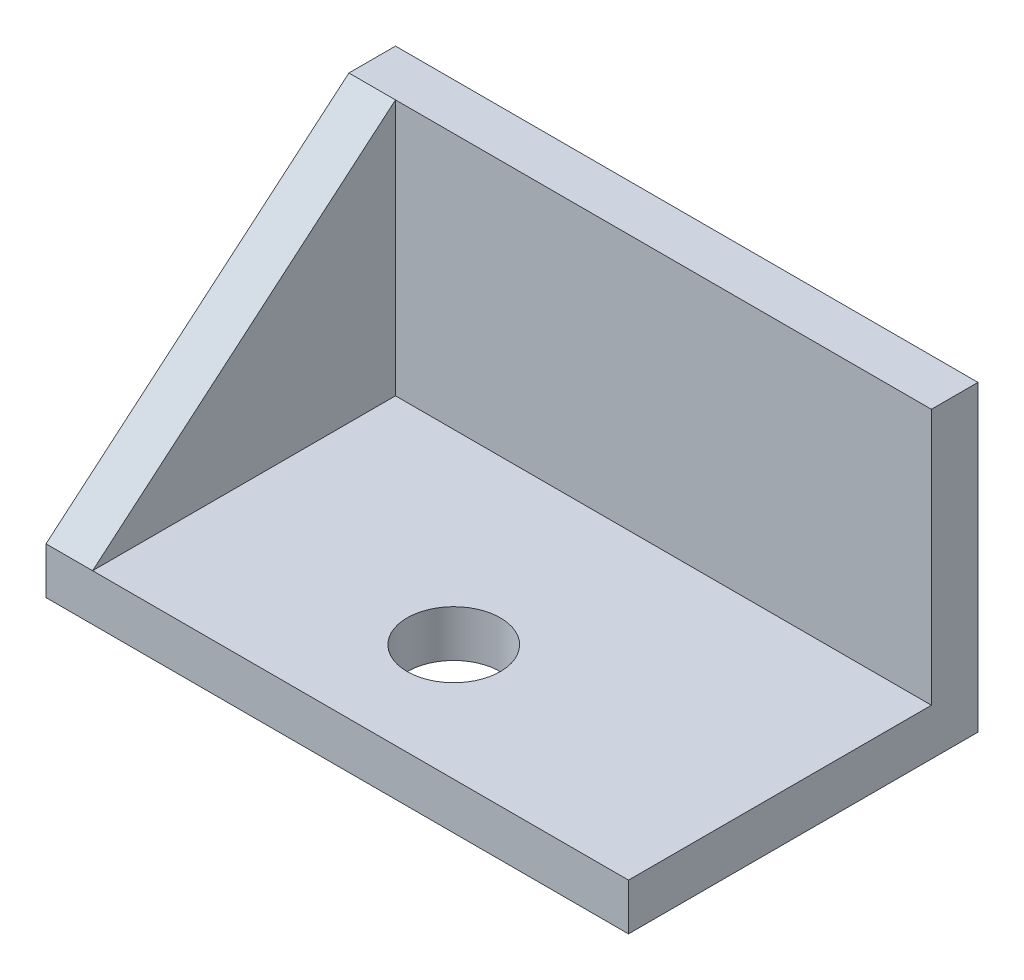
from build123d import *

# Parameters (mm, degrees)
SKETCH1_W           = 125
SKETCH1_H           = 65
BOSS_EXTRUDE1_DEPTH = 75
CUT_EXTRUDE1_DEPTH  = 160.608896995
CUT_EXTRUDE3_DEPTH  = 115
SKETCH5_R           = 10
CUT_EXTRUDE4_DEPTH  = 156.804364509


with BuildPart() as part:
    # Sketch1 → Boss-Extrude1 (new body)
    with BuildSketch(Plane.XY):
        with Locations((62.5, 32.5)):
            Rectangle(SKETCH1_W, SKETCH1_H)
    extrude(amount=BOSS_EXTRUDE1_DEPTH)

    # Sketch3 → Cut-Extrude1 (cut, through all)
    with BuildSketch(Plane(origin=(125, 0, 0), x_dir=(0, 0, -1), z_dir=(1, 0, 0))):
        Polygon((-75, 10), (-10, 65), (-75, 65), align=None)
    extrude(amount=-CUT_EXTRUDE1_DEPTH, mode=Mode.SUBTRACT)

    # Sketch4 → Cut-Extrude3 (cut)
    with BuildSketch(Plane(origin=(125, 0, 0), x_dir=(0, 0, -1), z_dir=(1, 0, 0))):
        Polygon((-10, 65), (-10, 10), (-75, 10), align=None)
    extrude(amount=-CUT_EXTRUDE3_DEPTH, mode=Mode.SUBTRACT)

    # Sketch5 → Cut-Extrude4 (cut, through all)
    with BuildSketch(Plane(origin=(0, 10, 0), x_dir=(1, 0, 0), z_dir=(0, 1, 0))):
        with Locations(Location((62.5, -50, 0), (0, 0, 270))):
            Circle(SKETCH5_R)
    extrude(amount=-CUT_EXTRUDE4_DEPTH, mode=Mode.SUBTRACT)


solid = part.part
